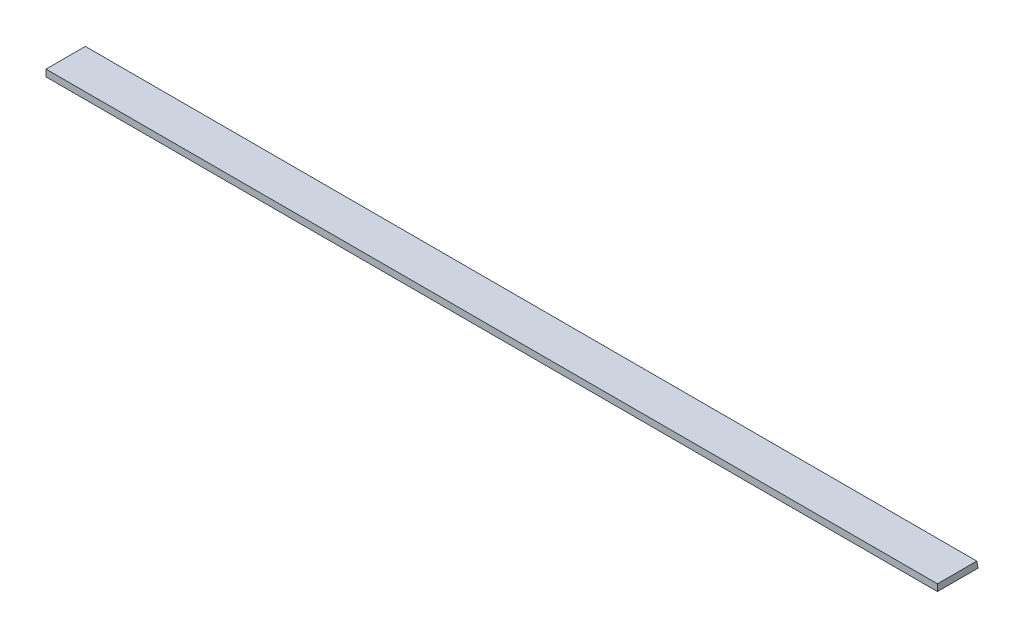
ISO-10303-21;
HEADER;
FILE_DESCRIPTION(('STEP AP214'),'2;1');
FILE_NAME('part.step','',(''),(''),'','','');
FILE_SCHEMA(('AUTOMOTIVE_DESIGN { 1 0 10303 214 1 1 1 1 }'));
ENDSEC;
DATA;
#1=APPLICATION_CONTEXT('core data for automotive mechanical design processes');
#2=APPLICATION_PROTOCOL_DEFINITION('international standard','automotive_design',2000,#1);
#3=PRODUCT_CONTEXT('',#1,'mechanical');
#4=PRODUCT('Part','Part','',(#3));
#5=PRODUCT_RELATED_PRODUCT_CATEGORY('part','',(#4));
#6=PRODUCT_DEFINITION_FORMATION('','',#4);
#7=PRODUCT_DEFINITION_CONTEXT('part definition',#1,'design');
#8=PRODUCT_DEFINITION('design','',#6,#7);
#9=PRODUCT_DEFINITION_SHAPE('','',#8);
#10=(LENGTH_UNIT() NAMED_UNIT(*) SI_UNIT(.MILLI.,.METRE.));
#11=(NAMED_UNIT(*) PLANE_ANGLE_UNIT() SI_UNIT($,.RADIAN.));
#12=(NAMED_UNIT(*) SI_UNIT($,.STERADIAN.) SOLID_ANGLE_UNIT());
#13=UNCERTAINTY_MEASURE_WITH_UNIT(LENGTH_MEASURE(1.E-05),#10,'distance_accuracy_value','');
#14=(GEOMETRIC_REPRESENTATION_CONTEXT(3) GLOBAL_UNCERTAINTY_ASSIGNED_CONTEXT((#13)) GLOBAL_UNIT_ASSIGNED_CONTEXT((#10,
#11,#12)) REPRESENTATION_CONTEXT('',''));
#15=CARTESIAN_POINT('',(0.,0.,0.));
#16=DIRECTION('',(0.,0.,1.));
#17=DIRECTION('',(1.,0.,0.));
#18=AXIS2_PLACEMENT_3D('',#15,#16,#17);
#19=CARTESIAN_POINT('',(330.,5.,15.));
#20=DIRECTION('',(0.,0.,-1.));
#21=DIRECTION('',(0.,1.,0.));
#22=AXIS2_PLACEMENT_3D('',#19,#20,#21);
#23=PLANE('',#22);
#24=DIRECTION('',(0.,-1.,0.));
#25=VECTOR('',#24,1.);
#26=CARTESIAN_POINT('',(-330.,5.,15.));
#27=LINE('',#26,#25);
#28=CARTESIAN_POINT('',(-330.,5.,15.));
#29=VERTEX_POINT('',#28);
#30=CARTESIAN_POINT('',(-330.,0.,15.));
#31=VERTEX_POINT('',#30);
#32=EDGE_CURVE('E83',#29,#31,#27,.T.);
#33=ORIENTED_EDGE('',*,*,#32,.T.);
#34=DIRECTION('',(-1.,0.,0.));
#35=VECTOR('',#34,1.);
#36=CARTESIAN_POINT('',(330.,0.,15.));
#37=LINE('',#36,#35);
#38=CARTESIAN_POINT('',(330.,0.,15.));
#39=VERTEX_POINT('',#38);
#40=EDGE_CURVE('E11',#39,#31,#37,.T.);
#41=ORIENTED_EDGE('',*,*,#40,.F.);
#42=DIRECTION('',(0.,-1.,0.));
#43=VECTOR('',#42,1.);
#44=CARTESIAN_POINT('',(330.,5.,15.));
#45=LINE('',#44,#43);
#46=CARTESIAN_POINT('',(330.,5.,15.));
#47=VERTEX_POINT('',#46);
#48=EDGE_CURVE('E106',#47,#39,#45,.T.);
#49=ORIENTED_EDGE('',*,*,#48,.F.);
#50=DIRECTION('',(-1.,0.,0.));
#51=VECTOR('',#50,1.);
#52=CARTESIAN_POINT('',(330.,5.,15.));
#53=LINE('',#52,#51);
#54=EDGE_CURVE('E96',#47,#29,#53,.T.);
#55=ORIENTED_EDGE('',*,*,#54,.T.);
#56=EDGE_LOOP('',(#33,#41,#49,#55));
#57=FACE_BOUND('',#56,.T.);
#58=ADVANCED_FACE('F38',(#57),#23,.F.);
#59=CARTESIAN_POINT('',(330.,0.,15.));
#60=DIRECTION('',(0.,1.,0.));
#61=DIRECTION('',(0.,0.,1.));
#62=AXIS2_PLACEMENT_3D('',#59,#60,#61);
#63=PLANE('',#62);
#64=DIRECTION('',(0.,0.,-1.));
#65=VECTOR('',#64,1.);
#66=CARTESIAN_POINT('',(-330.,0.,15.));
#67=LINE('',#66,#65);
#68=CARTESIAN_POINT('',(-330.,0.,-15.));
#69=VERTEX_POINT('',#68);
#70=EDGE_CURVE('E79',#31,#69,#67,.T.);
#71=ORIENTED_EDGE('',*,*,#70,.T.);
#72=DIRECTION('',(-1.,0.,0.));
#73=VECTOR('',#72,1.);
#74=CARTESIAN_POINT('',(330.,0.,-15.));
#75=LINE('',#74,#73);
#76=CARTESIAN_POINT('',(330.,0.,-15.));
#77=VERTEX_POINT('',#76);
#78=EDGE_CURVE('E46',#77,#69,#75,.T.);
#79=ORIENTED_EDGE('',*,*,#78,.F.);
#80=DIRECTION('',(0.,0.,-1.));
#81=VECTOR('',#80,1.);
#82=CARTESIAN_POINT('',(330.,0.,15.));
#83=LINE('',#82,#81);
#84=EDGE_CURVE('E92',#39,#77,#83,.T.);
#85=ORIENTED_EDGE('',*,*,#84,.F.);
#86=ORIENTED_EDGE('',*,*,#40,.T.);
#87=EDGE_LOOP('',(#71,#79,#85,#86));
#88=FACE_BOUND('',#87,.T.);
#89=ADVANCED_FACE('F91',(#88),#63,.F.);
#90=CARTESIAN_POINT('',(330.,5.,-14.1183650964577));
#91=DIRECTION('',(0.,-0.173648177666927,0.984807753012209));
#92=DIRECTION('',(0.,-0.984807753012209,-0.173648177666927));
#93=AXIS2_PLACEMENT_3D('',#90,#91,#92);
#94=PLANE('',#93);
#95=DIRECTION('',(0.,0.984807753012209,0.173648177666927));
#96=VECTOR('',#95,1.);
#97=CARTESIAN_POINT('',(-330.,5.,-14.1183650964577));
#98=LINE('',#97,#96);
#99=CARTESIAN_POINT('',(-330.,5.,-14.1183650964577));
#100=VERTEX_POINT('',#99);
#101=EDGE_CURVE('E84',#69,#100,#98,.T.);
#102=ORIENTED_EDGE('',*,*,#101,.T.);
#103=DIRECTION('',(-1.,0.,0.));
#104=VECTOR('',#103,1.);
#105=CARTESIAN_POINT('',(330.,5.,-14.1183650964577));
#106=LINE('',#105,#104);
#107=CARTESIAN_POINT('',(330.,5.,-14.1183650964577));
#108=VERTEX_POINT('',#107);
#109=EDGE_CURVE('E116',#108,#100,#106,.T.);
#110=ORIENTED_EDGE('',*,*,#109,.F.);
#111=DIRECTION('',(0.,0.984807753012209,0.173648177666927));
#112=VECTOR('',#111,1.);
#113=CARTESIAN_POINT('',(330.,5.,-14.1183650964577));
#114=LINE('',#113,#112);
#115=EDGE_CURVE('E58',#77,#108,#114,.T.);
#116=ORIENTED_EDGE('',*,*,#115,.F.);
#117=ORIENTED_EDGE('',*,*,#78,.T.);
#118=EDGE_LOOP('',(#102,#110,#116,#117));
#119=FACE_BOUND('',#118,.T.);
#120=ADVANCED_FACE('F121',(#119),#94,.F.);
#121=CARTESIAN_POINT('',(330.,5.,15.));
#122=DIRECTION('',(0.,-1.,0.));
#123=DIRECTION('',(0.,0.,-1.));
#124=AXIS2_PLACEMENT_3D('',#121,#122,#123);
#125=PLANE('',#124);
#126=DIRECTION('',(0.,0.,1.));
#127=VECTOR('',#126,1.);
#128=CARTESIAN_POINT('',(-330.,5.,15.));
#129=LINE('',#128,#127);
#130=EDGE_CURVE('E103',#100,#29,#129,.T.);
#131=ORIENTED_EDGE('',*,*,#130,.T.);
#132=ORIENTED_EDGE('',*,*,#54,.F.);
#133=DIRECTION('',(0.,0.,1.));
#134=VECTOR('',#133,1.);
#135=CARTESIAN_POINT('',(330.,5.,15.));
#136=LINE('',#135,#134);
#137=EDGE_CURVE('E53',#108,#47,#136,.T.);
#138=ORIENTED_EDGE('',*,*,#137,.F.);
#139=ORIENTED_EDGE('',*,*,#109,.T.);
#140=EDGE_LOOP('',(#131,#132,#138,#139));
#141=FACE_BOUND('',#140,.T.);
#142=ADVANCED_FACE('F123',(#141),#125,.F.);
#143=CARTESIAN_POINT('',(330.,5.,15.));
#144=DIRECTION('',(1.,0.,0.));
#145=DIRECTION('',(0.,0.,-1.));
#146=AXIS2_PLACEMENT_3D('',#143,#144,#145);
#147=PLANE('',#146);
#148=ORIENTED_EDGE('',*,*,#48,.T.);
#149=ORIENTED_EDGE('',*,*,#84,.T.);
#150=ORIENTED_EDGE('',*,*,#115,.T.);
#151=ORIENTED_EDGE('',*,*,#137,.T.);
#152=EDGE_LOOP('',(#148,#149,#150,#151));
#153=FACE_BOUND('',#152,.T.);
#154=ADVANCED_FACE('F124',(#153),#147,.T.);
#155=CARTESIAN_POINT('',(-330.,5.,15.));
#156=DIRECTION('',(1.,0.,0.));
#157=DIRECTION('',(0.,0.,-1.));
#158=AXIS2_PLACEMENT_3D('',#155,#156,#157);
#159=PLANE('',#158);
#160=ORIENTED_EDGE('',*,*,#32,.F.);
#161=ORIENTED_EDGE('',*,*,#130,.F.);
#162=ORIENTED_EDGE('',*,*,#101,.F.);
#163=ORIENTED_EDGE('',*,*,#70,.F.);
#164=EDGE_LOOP('',(#160,#161,#162,#163));
#165=FACE_BOUND('',#164,.T.);
#166=ADVANCED_FACE('F80',(#165),#159,.F.);
#167=CLOSED_SHELL('',(#58,#89,#120,#142,#154,#166));
#168=MANIFOLD_SOLID_BREP('B2',#167);
#169=ADVANCED_BREP_SHAPE_REPRESENTATION('',(#18,#168),#14);
#170=SHAPE_DEFINITION_REPRESENTATION(#9,#169);
ENDSEC;
END-ISO-10303-21;
